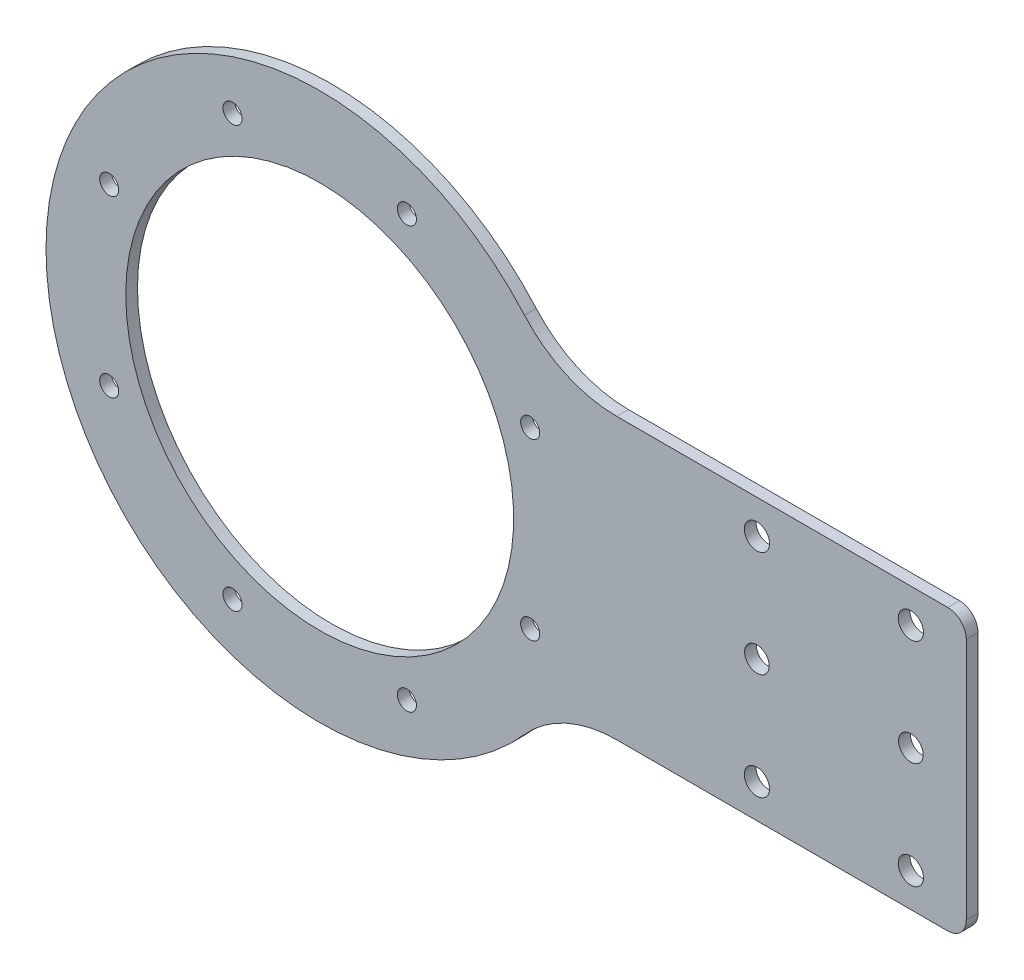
from build123d import *

# Parameters (mm, degrees)
SKETCH1_R           = 31.5
SKETCH1_R_2         = 1.55
SKETCH1_R_3         = 2.05
BOSS_EXTRUDE1_DEPTH = 1.905
FILLET1_R           = 20
FILLET2_R           = 3
SKETCH2_R           = 2
CUT_EXTRUDE1_DEPTH  = 115.036974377


with BuildPart() as part:
    # Sketch1 → Boss-Extrude1 (new body)
    with BuildSketch(Plane(origin=(0, 0, 0), x_dir=(0, 1, 0), z_dir=(0, 0, 1))):
        with BuildLine():
            Line((-22.75, -38.186908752), (-22.75, -105))
            Line((-22.75, -105), (22.75, -105))
            Line((22.75, -105), (22.75, -38.186908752))
            ThreePointArc((22.75, -38.186908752), (0, 44.45), (-22.75, -38.186908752))
        make_face()
        with Locations(Location((0, 0, 0), (0, 0, 90))):
            Circle(SKETCH1_R, mode=Mode.SUBTRACT)
        with Locations(Location((-34.183542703, 14.159286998, 0), (0, 0, 90))):
            Circle(SKETCH1_R_2, mode=Mode.SUBTRACT)
        with Locations(Location((-14.159286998, 34.183542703, 0), (0, 0, 90))):
            Circle(SKETCH1_R_2, mode=Mode.SUBTRACT)
        with Locations(Location((14.159286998, 34.183542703, 0), (0, 0, 90))):
            Circle(SKETCH1_R_2, mode=Mode.SUBTRACT)
        with Locations(Location((34.183542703, 14.159286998, 0), (0, 0, 90))):
            Circle(SKETCH1_R_2, mode=Mode.SUBTRACT)
        with Locations(Location((34.183542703, -14.159286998, 0), (0, 0, 90))):
            Circle(SKETCH1_R_2, mode=Mode.SUBTRACT)
        with Locations(Location((14.159286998, -34.183542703, 0), (0, 0, 90))):
            Circle(SKETCH1_R_2, mode=Mode.SUBTRACT)
        with Locations(Location((-14.159286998, -34.183542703, 0), (0, 0, 90))):
            Circle(SKETCH1_R_2, mode=Mode.SUBTRACT)
        with Locations(Location((-34.183542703, -14.159286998, 0), (0, 0, 90))):
            Circle(SKETCH1_R_2, mode=Mode.SUBTRACT)
        with Locations(Location((-17.25, -96, 0), (0, 0, 90))):
            Circle(SKETCH1_R_3, mode=Mode.SUBTRACT)
        with Locations(Location((17.25, -96, 0), (0, 0, 90))):
            Circle(SKETCH1_R_3, mode=Mode.SUBTRACT)
        with Locations(Location((-17.25, -71, 0), (0, 0, 90))):
            Circle(SKETCH1_R_3, mode=Mode.SUBTRACT)
        with Locations(Location((17.25, -71, 0), (0, 0, 90))):
            Circle(SKETCH1_R_3, mode=Mode.SUBTRACT)
    extrude(amount=BOSS_EXTRUDE1_DEPTH)

    # Fillet1
    fillet1_edges = [part.edges().sort_by_distance(p)[0] for p in [
        (38.186908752, -22.75, 0.9525),
        (38.186908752, 22.75, 0.9525),
    ]]
    fillet(fillet1_edges, radius=FILLET1_R)

    # Fillet2
    fillet2_edges = [part.edges().sort_by_distance(p)[0] for p in [
        (105, 22.75, 0.9525),
        (105, -22.75, 0.9525),
    ]]
    fillet(fillet2_edges, radius=FILLET2_R)

    # Sketch2 → Cut-Extrude1 (cut, through all)
    with BuildSketch(Plane.XY.offset(1.905)):
        with Locations((71, 0)):
            Circle(SKETCH2_R)
        with Locations((96, 0)):
            Circle(SKETCH2_R)
    extrude(amount=-CUT_EXTRUDE1_DEPTH, mode=Mode.SUBTRACT)


solid = part.part
